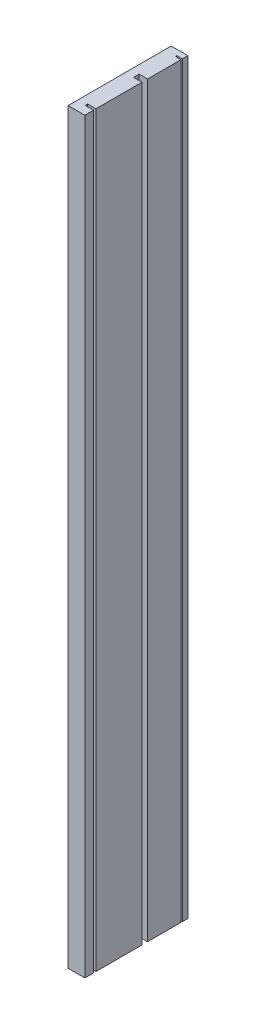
ISO-10303-21;
HEADER;
FILE_DESCRIPTION(('STEP AP214'),'2;1');
FILE_NAME('part.step','',(''),(''),'','','');
FILE_SCHEMA(('AUTOMOTIVE_DESIGN { 1 0 10303 214 1 1 1 1 }'));
ENDSEC;
DATA;
#1=APPLICATION_CONTEXT('core data for automotive mechanical design processes');
#2=APPLICATION_PROTOCOL_DEFINITION('international standard','automotive_design',2000,#1);
#3=PRODUCT_CONTEXT('',#1,'mechanical');
#4=PRODUCT('Part','Part','',(#3));
#5=PRODUCT_RELATED_PRODUCT_CATEGORY('part','',(#4));
#6=PRODUCT_DEFINITION_FORMATION('','',#4);
#7=PRODUCT_DEFINITION_CONTEXT('part definition',#1,'design');
#8=PRODUCT_DEFINITION('design','',#6,#7);
#9=PRODUCT_DEFINITION_SHAPE('','',#8);
#10=(LENGTH_UNIT() NAMED_UNIT(*) SI_UNIT(.MILLI.,.METRE.));
#11=(NAMED_UNIT(*) PLANE_ANGLE_UNIT() SI_UNIT($,.RADIAN.));
#12=(NAMED_UNIT(*) SI_UNIT($,.STERADIAN.) SOLID_ANGLE_UNIT());
#13=UNCERTAINTY_MEASURE_WITH_UNIT(LENGTH_MEASURE(1.E-05),#10,'distance_accuracy_value','');
#14=(GEOMETRIC_REPRESENTATION_CONTEXT(3) GLOBAL_UNCERTAINTY_ASSIGNED_CONTEXT((#13)) GLOBAL_UNIT_ASSIGNED_CONTEXT((#10,
#11,#12)) REPRESENTATION_CONTEXT('',''));
#15=CARTESIAN_POINT('',(0.,0.,0.));
#16=DIRECTION('',(0.,0.,1.));
#17=DIRECTION('',(1.,0.,0.));
#18=AXIS2_PLACEMENT_3D('',#15,#16,#17);
#19=CARTESIAN_POINT('',(19.05,0.,0.));
#20=DIRECTION('',(-1.,0.,0.));
#21=DIRECTION('',(0.,0.,1.));
#22=AXIS2_PLACEMENT_3D('',#19,#20,#21);
#23=PLANE('',#22);
#24=DIRECTION('',(0.,-1.,0.));
#25=VECTOR('',#24,1.);
#26=CARTESIAN_POINT('',(19.05,0.,0.));
#27=LINE('',#26,#25);
#28=CARTESIAN_POINT('',(19.05,1219.2,2.22044604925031E-13));
#29=VERTEX_POINT('',#28);
#30=CARTESIAN_POINT('',(19.05,-482.6,0.));
#31=VERTEX_POINT('',#30);
#32=EDGE_CURVE('E85',#29,#31,#27,.T.);
#33=ORIENTED_EDGE('',*,*,#32,.T.);
#34=DIRECTION('',(0.,0.,-1.));
#35=VECTOR('',#34,1.);
#36=CARTESIAN_POINT('',(19.05,-482.6,-19.8119999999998));
#37=LINE('',#36,#35);
#38=CARTESIAN_POINT('',(19.05,-482.6,-19.8119999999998));
#39=VERTEX_POINT('',#38);
#40=EDGE_CURVE('E179',#31,#39,#37,.T.);
#41=ORIENTED_EDGE('',*,*,#40,.T.);
#42=DIRECTION('',(0.,1.,0.));
#43=VECTOR('',#42,1.);
#44=CARTESIAN_POINT('',(19.05,0.,-19.8119999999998));
#45=LINE('',#44,#43);
#46=CARTESIAN_POINT('',(19.05,1219.2,-19.8119999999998));
#47=VERTEX_POINT('',#46);
#48=EDGE_CURVE('E99',#39,#47,#45,.T.);
#49=ORIENTED_EDGE('',*,*,#48,.T.);
#50=DIRECTION('',(0.,0.,1.));
#51=VECTOR('',#50,1.);
#52=CARTESIAN_POINT('',(19.05,1219.2,2.22044604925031E-13));
#53=LINE('',#52,#51);
#54=EDGE_CURVE('E63',#47,#29,#53,.T.);
#55=ORIENTED_EDGE('',*,*,#54,.T.);
#56=EDGE_LOOP('',(#33,#41,#49,#55));
#57=FACE_BOUND('',#56,.T.);
#58=ADVANCED_FACE('F39',(#57),#23,.F.);
#59=CARTESIAN_POINT('',(19.05,1219.2,-130.175));
#60=VERTEX_POINT('',#59);
#61=CARTESIAN_POINT('',(19.05,1219.2,-25.3999999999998));
#62=VERTEX_POINT('',#61);
#63=EDGE_CURVE('E237',#60,#62,#53,.T.);
#64=ORIENTED_EDGE('',*,*,#63,.T.);
#65=DIRECTION('',(0.,1.,0.));
#66=VECTOR('',#65,1.);
#67=CARTESIAN_POINT('',(19.05,0.,-25.3999999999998));
#68=LINE('',#67,#66);
#69=CARTESIAN_POINT('',(19.05,-482.6,-25.3999999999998));
#70=VERTEX_POINT('',#69);
#71=EDGE_CURVE('E151',#70,#62,#68,.T.);
#72=ORIENTED_EDGE('',*,*,#71,.F.);
#73=DIRECTION('',(0.,0.,-1.));
#74=VECTOR('',#73,1.);
#75=CARTESIAN_POINT('',(19.05,-482.6,-130.175));
#76=LINE('',#75,#74);
#77=CARTESIAN_POINT('',(19.05,-482.6,-130.175));
#78=VERTEX_POINT('',#77);
#79=EDGE_CURVE('E167',#70,#78,#76,.T.);
#80=ORIENTED_EDGE('',*,*,#79,.T.);
#81=DIRECTION('',(0.,1.,0.));
#82=VECTOR('',#81,1.);
#83=CARTESIAN_POINT('',(19.05,0.,-130.175));
#84=LINE('',#83,#82);
#85=EDGE_CURVE('E140',#78,#60,#84,.T.);
#86=ORIENTED_EDGE('',*,*,#85,.T.);
#87=EDGE_LOOP('',(#64,#72,#80,#86));
#88=FACE_BOUND('',#87,.T.);
#89=ADVANCED_FACE('F233',(#88),#23,.F.);
#90=CARTESIAN_POINT('',(19.05,1219.2,-234.95));
#91=VERTEX_POINT('',#90);
#92=CARTESIAN_POINT('',(19.05,1219.2,-222.25));
#93=VERTEX_POINT('',#92);
#94=EDGE_CURVE('E94',#91,#93,#53,.T.);
#95=ORIENTED_EDGE('',*,*,#94,.T.);
#96=DIRECTION('',(0.,1.,0.));
#97=VECTOR('',#96,1.);
#98=CARTESIAN_POINT('',(19.05,0.,-222.25));
#99=LINE('',#98,#97);
#100=CARTESIAN_POINT('',(19.05,-482.6,-222.25));
#101=VERTEX_POINT('',#100);
#102=EDGE_CURVE('E120',#101,#93,#99,.T.);
#103=ORIENTED_EDGE('',*,*,#102,.F.);
#104=DIRECTION('',(0.,0.,-1.));
#105=VECTOR('',#104,1.);
#106=CARTESIAN_POINT('',(19.05,-482.6,-234.95));
#107=LINE('',#106,#105);
#108=CARTESIAN_POINT('',(19.05,-482.6,-234.95));
#109=VERTEX_POINT('',#108);
#110=EDGE_CURVE('E188',#101,#109,#107,.T.);
#111=ORIENTED_EDGE('',*,*,#110,.T.);
#112=DIRECTION('',(0.,1.,0.));
#113=VECTOR('',#112,1.);
#114=CARTESIAN_POINT('',(19.05,0.,-234.95));
#115=LINE('',#114,#113);
#116=EDGE_CURVE('E108',#109,#91,#115,.T.);
#117=ORIENTED_EDGE('',*,*,#116,.T.);
#118=EDGE_LOOP('',(#95,#103,#111,#117));
#119=FACE_BOUND('',#118,.T.);
#120=ADVANCED_FACE('F321',(#119),#23,.F.);
#121=CARTESIAN_POINT('',(19.05,0.,0.));
#122=DIRECTION('',(0.,0.,-1.));
#123=DIRECTION('',(0.,1.,0.));
#124=AXIS2_PLACEMENT_3D('',#121,#122,#123);
#125=PLANE('',#124);
#126=DIRECTION('',(0.,-1.,0.));
#127=VECTOR('',#126,1.);
#128=CARTESIAN_POINT('',(-19.05,0.,0.));
#129=LINE('',#128,#127);
#130=CARTESIAN_POINT('',(-19.05,1219.2,2.22044604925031E-13));
#131=VERTEX_POINT('',#130);
#132=CARTESIAN_POINT('',(-19.05,-482.6,0.));
#133=VERTEX_POINT('',#132);
#134=EDGE_CURVE('E92',#131,#133,#129,.T.);
#135=ORIENTED_EDGE('',*,*,#134,.T.);
#136=DIRECTION('',(1.,0.,0.));
#137=VECTOR('',#136,1.);
#138=CARTESIAN_POINT('',(19.05,-482.6,0.));
#139=LINE('',#138,#137);
#140=EDGE_CURVE('E182',#133,#31,#139,.T.);
#141=ORIENTED_EDGE('',*,*,#140,.T.);
#142=ORIENTED_EDGE('',*,*,#32,.F.);
#143=DIRECTION('',(-1.,0.,0.));
#144=VECTOR('',#143,1.);
#145=CARTESIAN_POINT('',(19.05,1219.2,2.22044604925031E-13));
#146=LINE('',#145,#144);
#147=EDGE_CURVE('E47',#29,#131,#146,.T.);
#148=ORIENTED_EDGE('',*,*,#147,.T.);
#149=EDGE_LOOP('',(#135,#141,#142,#148));
#150=FACE_BOUND('',#149,.T.);
#151=ADVANCED_FACE('F41',(#150),#125,.F.);
#152=CARTESIAN_POINT('',(19.05,0.,-234.95));
#153=DIRECTION('',(0.,0.,1.));
#154=DIRECTION('',(0.,-1.,0.));
#155=AXIS2_PLACEMENT_3D('',#152,#153,#154);
#156=PLANE('',#155);
#157=DIRECTION('',(0.,1.,0.));
#158=VECTOR('',#157,1.);
#159=CARTESIAN_POINT('',(-19.05,0.,-234.95));
#160=LINE('',#159,#158);
#161=CARTESIAN_POINT('',(-19.05,-482.6,-234.95));
#162=VERTEX_POINT('',#161);
#163=CARTESIAN_POINT('',(-19.05,1219.2,-234.95));
#164=VERTEX_POINT('',#163);
#165=EDGE_CURVE('E86',#162,#164,#160,.T.);
#166=ORIENTED_EDGE('',*,*,#165,.T.);
#167=DIRECTION('',(-1.,0.,0.));
#168=VECTOR('',#167,1.);
#169=CARTESIAN_POINT('',(19.05,1219.2,-234.95));
#170=LINE('',#169,#168);
#171=EDGE_CURVE('E11',#91,#164,#170,.T.);
#172=ORIENTED_EDGE('',*,*,#171,.F.);
#173=ORIENTED_EDGE('',*,*,#116,.F.);
#174=DIRECTION('',(-1.,0.,0.));
#175=VECTOR('',#174,1.);
#176=CARTESIAN_POINT('',(-19.05,-482.6,-234.95));
#177=LINE('',#176,#175);
#178=EDGE_CURVE('E185',#109,#162,#177,.T.);
#179=ORIENTED_EDGE('',*,*,#178,.T.);
#180=EDGE_LOOP('',(#166,#172,#173,#179));
#181=FACE_BOUND('',#180,.T.);
#182=ADVANCED_FACE('F329',(#181),#156,.F.);
#183=CARTESIAN_POINT('',(19.05,1219.2,2.22044604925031E-13));
#184=DIRECTION('',(0.,-1.,0.));
#185=DIRECTION('',(0.,0.,-1.));
#186=AXIS2_PLACEMENT_3D('',#183,#184,#185);
#187=PLANE('',#186);
#188=ORIENTED_EDGE('',*,*,#54,.F.);
#189=DIRECTION('',(1.,0.,0.));
#190=VECTOR('',#189,1.);
#191=CARTESIAN_POINT('',(0.,1219.2,-19.8119999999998));
#192=LINE('',#191,#190);
#193=CARTESIAN_POINT('',(0.,1219.2,-19.8119999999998));
#194=VERTEX_POINT('',#193);
#195=EDGE_CURVE('E155',#194,#47,#192,.T.);
#196=ORIENTED_EDGE('',*,*,#195,.F.);
#197=DIRECTION('',(0.,0.,1.));
#198=VECTOR('',#197,1.);
#199=CARTESIAN_POINT('',(0.,1219.2,-25.3999999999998));
#200=LINE('',#199,#198);
#201=CARTESIAN_POINT('',(0.,1219.2,-25.3999999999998));
#202=VERTEX_POINT('',#201);
#203=EDGE_CURVE('E162',#202,#194,#200,.T.);
#204=ORIENTED_EDGE('',*,*,#203,.F.);
#205=DIRECTION('',(-1.,0.,0.));
#206=VECTOR('',#205,1.);
#207=CARTESIAN_POINT('',(19.05,1219.2,-25.3999999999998));
#208=LINE('',#207,#206);
#209=EDGE_CURVE('E133',#62,#202,#208,.T.);
#210=ORIENTED_EDGE('',*,*,#209,.F.);
#211=ORIENTED_EDGE('',*,*,#63,.F.);
#212=DIRECTION('',(1.,0.,0.));
#213=VECTOR('',#212,1.);
#214=CARTESIAN_POINT('',(0.,1219.2,-130.175));
#215=LINE('',#214,#213);
#216=CARTESIAN_POINT('',(0.,1219.2,-130.175));
#217=VERTEX_POINT('',#216);
#218=EDGE_CURVE('E130',#217,#60,#215,.T.);
#219=ORIENTED_EDGE('',*,*,#218,.F.);
#220=DIRECTION('',(0.,0.,1.));
#221=VECTOR('',#220,1.);
#222=CARTESIAN_POINT('',(0.,1219.2,-142.875));
#223=LINE('',#222,#221);
#224=CARTESIAN_POINT('',(0.,1219.2,-142.875));
#225=VERTEX_POINT('',#224);
#226=EDGE_CURVE('E137',#225,#217,#223,.T.);
#227=ORIENTED_EDGE('',*,*,#226,.F.);
#228=DIRECTION('',(-1.,0.,0.));
#229=VECTOR('',#228,1.);
#230=CARTESIAN_POINT('',(19.05,1219.2,-142.875));
#231=LINE('',#230,#229);
#232=CARTESIAN_POINT('',(19.05,1219.2,-142.875));
#233=VERTEX_POINT('',#232);
#234=EDGE_CURVE('E134',#233,#225,#231,.T.);
#235=ORIENTED_EDGE('',*,*,#234,.F.);
#236=CARTESIAN_POINT('',(19.05,1219.2,-219.075));
#237=VERTEX_POINT('',#236);
#238=EDGE_CURVE('E107',#237,#233,#53,.T.);
#239=ORIENTED_EDGE('',*,*,#238,.F.);
#240=DIRECTION('',(1.,0.,0.));
#241=VECTOR('',#240,1.);
#242=CARTESIAN_POINT('',(19.05,1219.2,-219.075));
#243=LINE('',#242,#241);
#244=CARTESIAN_POINT('',(6.35,1219.2,-219.075));
#245=VERTEX_POINT('',#244);
#246=EDGE_CURVE('E54',#245,#237,#243,.T.);
#247=ORIENTED_EDGE('',*,*,#246,.F.);
#248=DIRECTION('',(0.,0.,1.));
#249=VECTOR('',#248,1.);
#250=CARTESIAN_POINT('',(6.35,1219.2,-219.075));
#251=LINE('',#250,#249);
#252=CARTESIAN_POINT('',(6.35,1219.2,-222.25));
#253=VERTEX_POINT('',#252);
#254=EDGE_CURVE('E115',#253,#245,#251,.T.);
#255=ORIENTED_EDGE('',*,*,#254,.F.);
#256=DIRECTION('',(-1.,0.,0.));
#257=VECTOR('',#256,1.);
#258=CARTESIAN_POINT('',(6.35,1219.2,-222.25));
#259=LINE('',#258,#257);
#260=EDGE_CURVE('E111',#93,#253,#259,.T.);
#261=ORIENTED_EDGE('',*,*,#260,.F.);
#262=ORIENTED_EDGE('',*,*,#94,.F.);
#263=ORIENTED_EDGE('',*,*,#171,.T.);
#264=DIRECTION('',(0.,0.,1.));
#265=VECTOR('',#264,1.);
#266=CARTESIAN_POINT('',(-19.05,1219.2,2.22044604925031E-13));
#267=LINE('',#266,#265);
#268=EDGE_CURVE('E76',#164,#131,#267,.T.);
#269=ORIENTED_EDGE('',*,*,#268,.T.);
#270=ORIENTED_EDGE('',*,*,#147,.F.);
#271=EDGE_LOOP('',(#188,#196,#204,#210,#211,#219,#227,#235,#239,#247,#255,#261,#262,#263,#269,#270));
#272=FACE_BOUND('',#271,.T.);
#273=ADVANCED_FACE('F78',(#272),#187,.F.);
#274=ORIENTED_EDGE('',*,*,#238,.T.);
#275=DIRECTION('',(0.,1.,0.));
#276=VECTOR('',#275,1.);
#277=CARTESIAN_POINT('',(19.05,0.,-142.875));
#278=LINE('',#277,#276);
#279=CARTESIAN_POINT('',(19.05,-482.6,-142.875));
#280=VERTEX_POINT('',#279);
#281=EDGE_CURVE('E146',#280,#233,#278,.T.);
#282=ORIENTED_EDGE('',*,*,#281,.F.);
#283=DIRECTION('',(0.,0.,-1.));
#284=VECTOR('',#283,1.);
#285=CARTESIAN_POINT('',(19.05,-482.6,-219.075));
#286=LINE('',#285,#284);
#287=CARTESIAN_POINT('',(19.05,-482.6,-219.075));
#288=VERTEX_POINT('',#287);
#289=EDGE_CURVE('E200',#280,#288,#286,.T.);
#290=ORIENTED_EDGE('',*,*,#289,.T.);
#291=DIRECTION('',(0.,1.,0.));
#292=VECTOR('',#291,1.);
#293=CARTESIAN_POINT('',(19.05,0.,-219.075));
#294=LINE('',#293,#292);
#295=EDGE_CURVE('E123',#288,#237,#294,.T.);
#296=ORIENTED_EDGE('',*,*,#295,.T.);
#297=EDGE_LOOP('',(#274,#282,#290,#296));
#298=FACE_BOUND('',#297,.T.);
#299=ADVANCED_FACE('F286',(#298),#23,.F.);
#300=CARTESIAN_POINT('',(-19.05,0.,0.));
#301=DIRECTION('',(-1.,0.,0.));
#302=DIRECTION('',(0.,0.,1.));
#303=AXIS2_PLACEMENT_3D('',#300,#301,#302);
#304=PLANE('',#303);
#305=ORIENTED_EDGE('',*,*,#134,.F.);
#306=ORIENTED_EDGE('',*,*,#268,.F.);
#307=ORIENTED_EDGE('',*,*,#165,.F.);
#308=DIRECTION('',(0.,0.,1.));
#309=VECTOR('',#308,1.);
#310=CARTESIAN_POINT('',(-19.05,-482.6,0.));
#311=LINE('',#310,#309);
#312=EDGE_CURVE('E98',#162,#133,#311,.T.);
#313=ORIENTED_EDGE('',*,*,#312,.T.);
#314=EDGE_LOOP('',(#305,#306,#307,#313));
#315=FACE_BOUND('',#314,.T.);
#316=ADVANCED_FACE('F96',(#315),#304,.T.);
#317=CARTESIAN_POINT('',(6.35,0.,-222.25));
#318=DIRECTION('',(0.,0.,-1.));
#319=DIRECTION('',(-1.,0.,0.));
#320=AXIS2_PLACEMENT_3D('',#317,#318,#319);
#321=PLANE('',#320);
#322=ORIENTED_EDGE('',*,*,#260,.T.);
#323=DIRECTION('',(0.,1.,0.));
#324=VECTOR('',#323,1.);
#325=CARTESIAN_POINT('',(6.35,0.,-222.25));
#326=LINE('',#325,#324);
#327=CARTESIAN_POINT('',(6.35,-482.6,-222.25));
#328=VERTEX_POINT('',#327);
#329=EDGE_CURVE('E119',#328,#253,#326,.T.);
#330=ORIENTED_EDGE('',*,*,#329,.F.);
#331=DIRECTION('',(1.,0.,0.));
#332=VECTOR('',#331,1.);
#333=CARTESIAN_POINT('',(19.05,-482.6,-222.25));
#334=LINE('',#333,#332);
#335=EDGE_CURVE('E191',#328,#101,#334,.T.);
#336=ORIENTED_EDGE('',*,*,#335,.T.);
#337=ORIENTED_EDGE('',*,*,#102,.T.);
#338=EDGE_LOOP('',(#322,#330,#336,#337));
#339=FACE_BOUND('',#338,.T.);
#340=ADVANCED_FACE('F278',(#339),#321,.F.);
#341=CARTESIAN_POINT('',(19.05,0.,-219.075));
#342=DIRECTION('',(0.,0.,1.));
#343=DIRECTION('',(1.,0.,0.));
#344=AXIS2_PLACEMENT_3D('',#341,#342,#343);
#345=PLANE('',#344);
#346=ORIENTED_EDGE('',*,*,#246,.T.);
#347=ORIENTED_EDGE('',*,*,#295,.F.);
#348=DIRECTION('',(-1.,0.,0.));
#349=VECTOR('',#348,1.);
#350=CARTESIAN_POINT('',(6.35,-482.6,-219.075));
#351=LINE('',#350,#349);
#352=CARTESIAN_POINT('',(6.35,-482.6,-219.075));
#353=VERTEX_POINT('',#352);
#354=EDGE_CURVE('E197',#288,#353,#351,.T.);
#355=ORIENTED_EDGE('',*,*,#354,.T.);
#356=DIRECTION('',(0.,1.,0.));
#357=VECTOR('',#356,1.);
#358=CARTESIAN_POINT('',(6.35,0.,-219.075));
#359=LINE('',#358,#357);
#360=EDGE_CURVE('E126',#353,#245,#359,.T.);
#361=ORIENTED_EDGE('',*,*,#360,.T.);
#362=EDGE_LOOP('',(#346,#347,#355,#361));
#363=FACE_BOUND('',#362,.T.);
#364=ADVANCED_FACE('F291',(#363),#345,.F.);
#365=CARTESIAN_POINT('',(6.35,0.,-219.075));
#366=DIRECTION('',(-1.,0.,0.));
#367=DIRECTION('',(0.,0.,1.));
#368=AXIS2_PLACEMENT_3D('',#365,#366,#367);
#369=PLANE('',#368);
#370=ORIENTED_EDGE('',*,*,#254,.T.);
#371=ORIENTED_EDGE('',*,*,#360,.F.);
#372=DIRECTION('',(0.,0.,-1.));
#373=VECTOR('',#372,1.);
#374=CARTESIAN_POINT('',(6.35,-482.6,-222.25));
#375=LINE('',#374,#373);
#376=EDGE_CURVE('E194',#353,#328,#375,.T.);
#377=ORIENTED_EDGE('',*,*,#376,.T.);
#378=ORIENTED_EDGE('',*,*,#329,.T.);
#379=EDGE_LOOP('',(#370,#371,#377,#378));
#380=FACE_BOUND('',#379,.T.);
#381=ADVANCED_FACE('F270',(#380),#369,.F.);
#382=CARTESIAN_POINT('',(0.,0.,-130.175));
#383=DIRECTION('',(0.,0.,1.));
#384=DIRECTION('',(1.,0.,0.));
#385=AXIS2_PLACEMENT_3D('',#382,#383,#384);
#386=PLANE('',#385);
#387=ORIENTED_EDGE('',*,*,#218,.T.);
#388=ORIENTED_EDGE('',*,*,#85,.F.);
#389=DIRECTION('',(-1.,0.,0.));
#390=VECTOR('',#389,1.);
#391=CARTESIAN_POINT('',(0.,-482.6,-130.175));
#392=LINE('',#391,#390);
#393=CARTESIAN_POINT('',(0.,-482.6,-130.175));
#394=VERTEX_POINT('',#393);
#395=EDGE_CURVE('E170',#78,#394,#392,.T.);
#396=ORIENTED_EDGE('',*,*,#395,.T.);
#397=DIRECTION('',(0.,1.,0.));
#398=VECTOR('',#397,1.);
#399=CARTESIAN_POINT('',(0.,0.,-130.175));
#400=LINE('',#399,#398);
#401=EDGE_CURVE('E114',#394,#217,#400,.T.);
#402=ORIENTED_EDGE('',*,*,#401,.T.);
#403=EDGE_LOOP('',(#387,#388,#396,#402));
#404=FACE_BOUND('',#403,.T.);
#405=ADVANCED_FACE('F214',(#404),#386,.F.);
#406=CARTESIAN_POINT('',(0.,0.,-142.875));
#407=DIRECTION('',(-1.,0.,0.));
#408=DIRECTION('',(0.,0.,1.));
#409=AXIS2_PLACEMENT_3D('',#406,#407,#408);
#410=PLANE('',#409);
#411=ORIENTED_EDGE('',*,*,#226,.T.);
#412=ORIENTED_EDGE('',*,*,#401,.F.);
#413=DIRECTION('',(0.,0.,-1.));
#414=VECTOR('',#413,1.);
#415=CARTESIAN_POINT('',(0.,-482.6,-142.875));
#416=LINE('',#415,#414);
#417=CARTESIAN_POINT('',(0.,-482.6,-142.875));
#418=VERTEX_POINT('',#417);
#419=EDGE_CURVE('E206',#394,#418,#416,.T.);
#420=ORIENTED_EDGE('',*,*,#419,.T.);
#421=DIRECTION('',(0.,1.,0.));
#422=VECTOR('',#421,1.);
#423=CARTESIAN_POINT('',(0.,0.,-142.875));
#424=LINE('',#423,#422);
#425=EDGE_CURVE('E143',#418,#225,#424,.T.);
#426=ORIENTED_EDGE('',*,*,#425,.T.);
#427=EDGE_LOOP('',(#411,#412,#420,#426));
#428=FACE_BOUND('',#427,.T.);
#429=ADVANCED_FACE('F411',(#428),#410,.F.);
#430=CARTESIAN_POINT('',(19.05,0.,-142.875));
#431=DIRECTION('',(0.,0.,-1.));
#432=DIRECTION('',(-1.,0.,0.));
#433=AXIS2_PLACEMENT_3D('',#430,#431,#432);
#434=PLANE('',#433);
#435=ORIENTED_EDGE('',*,*,#234,.T.);
#436=ORIENTED_EDGE('',*,*,#425,.F.);
#437=DIRECTION('',(1.,0.,0.));
#438=VECTOR('',#437,1.);
#439=CARTESIAN_POINT('',(19.05,-482.6,-142.875));
#440=LINE('',#439,#438);
#441=EDGE_CURVE('E203',#418,#280,#440,.T.);
#442=ORIENTED_EDGE('',*,*,#441,.T.);
#443=ORIENTED_EDGE('',*,*,#281,.T.);
#444=EDGE_LOOP('',(#435,#436,#442,#443));
#445=FACE_BOUND('',#444,.T.);
#446=ADVANCED_FACE('F400',(#445),#434,.F.);
#447=CARTESIAN_POINT('',(0.,0.,-19.8119999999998));
#448=DIRECTION('',(0.,0.,1.));
#449=DIRECTION('',(1.,0.,0.));
#450=AXIS2_PLACEMENT_3D('',#447,#448,#449);
#451=PLANE('',#450);
#452=ORIENTED_EDGE('',*,*,#195,.T.);
#453=ORIENTED_EDGE('',*,*,#48,.F.);
#454=DIRECTION('',(-1.,0.,0.));
#455=VECTOR('',#454,1.);
#456=CARTESIAN_POINT('',(0.,-482.6,-19.8119999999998));
#457=LINE('',#456,#455);
#458=CARTESIAN_POINT('',(0.,-482.6,-19.8119999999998));
#459=VERTEX_POINT('',#458);
#460=EDGE_CURVE('E176',#39,#459,#457,.T.);
#461=ORIENTED_EDGE('',*,*,#460,.T.);
#462=DIRECTION('',(0.,1.,0.));
#463=VECTOR('',#462,1.);
#464=CARTESIAN_POINT('',(0.,0.,-19.8119999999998));
#465=LINE('',#464,#463);
#466=EDGE_CURVE('E102',#459,#194,#465,.T.);
#467=ORIENTED_EDGE('',*,*,#466,.T.);
#468=EDGE_LOOP('',(#452,#453,#461,#467));
#469=FACE_BOUND('',#468,.T.);
#470=ADVANCED_FACE('F313',(#469),#451,.F.);
#471=CARTESIAN_POINT('',(0.,0.,-25.3999999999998));
#472=DIRECTION('',(-1.,0.,0.));
#473=DIRECTION('',(0.,0.,1.));
#474=AXIS2_PLACEMENT_3D('',#471,#472,#473);
#475=PLANE('',#474);
#476=ORIENTED_EDGE('',*,*,#203,.T.);
#477=ORIENTED_EDGE('',*,*,#466,.F.);
#478=DIRECTION('',(0.,0.,-1.));
#479=VECTOR('',#478,1.);
#480=CARTESIAN_POINT('',(0.,-482.6,-25.3999999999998));
#481=LINE('',#480,#479);
#482=CARTESIAN_POINT('',(0.,-482.6,-25.3999999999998));
#483=VERTEX_POINT('',#482);
#484=EDGE_CURVE('E173',#459,#483,#481,.T.);
#485=ORIENTED_EDGE('',*,*,#484,.T.);
#486=DIRECTION('',(0.,1.,0.));
#487=VECTOR('',#486,1.);
#488=CARTESIAN_POINT('',(0.,0.,-25.3999999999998));
#489=LINE('',#488,#487);
#490=EDGE_CURVE('E154',#483,#202,#489,.T.);
#491=ORIENTED_EDGE('',*,*,#490,.T.);
#492=EDGE_LOOP('',(#476,#477,#485,#491));
#493=FACE_BOUND('',#492,.T.);
#494=ADVANCED_FACE('F252',(#493),#475,.F.);
#495=CARTESIAN_POINT('',(19.05,0.,-25.3999999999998));
#496=DIRECTION('',(0.,0.,-1.));
#497=DIRECTION('',(-1.,0.,0.));
#498=AXIS2_PLACEMENT_3D('',#495,#496,#497);
#499=PLANE('',#498);
#500=ORIENTED_EDGE('',*,*,#209,.T.);
#501=ORIENTED_EDGE('',*,*,#490,.F.);
#502=DIRECTION('',(1.,0.,0.));
#503=VECTOR('',#502,1.);
#504=CARTESIAN_POINT('',(19.05,-482.6,-25.3999999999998));
#505=LINE('',#504,#503);
#506=EDGE_CURVE('E124',#483,#70,#505,.T.);
#507=ORIENTED_EDGE('',*,*,#506,.T.);
#508=ORIENTED_EDGE('',*,*,#71,.T.);
#509=EDGE_LOOP('',(#500,#501,#507,#508));
#510=FACE_BOUND('',#509,.T.);
#511=ADVANCED_FACE('F241',(#510),#499,.F.);
#512=CARTESIAN_POINT('',(88.1761,-482.6,-77.851));
#513=DIRECTION('',(0.,1.,0.));
#514=DIRECTION('',(1.,0.,0.));
#515=AXIS2_PLACEMENT_3D('',#512,#513,#514);
#516=PLANE('',#515);
#517=ORIENTED_EDGE('',*,*,#484,.F.);
#518=ORIENTED_EDGE('',*,*,#460,.F.);
#519=ORIENTED_EDGE('',*,*,#40,.F.);
#520=ORIENTED_EDGE('',*,*,#140,.F.);
#521=ORIENTED_EDGE('',*,*,#312,.F.);
#522=ORIENTED_EDGE('',*,*,#178,.F.);
#523=ORIENTED_EDGE('',*,*,#110,.F.);
#524=ORIENTED_EDGE('',*,*,#335,.F.);
#525=ORIENTED_EDGE('',*,*,#376,.F.);
#526=ORIENTED_EDGE('',*,*,#354,.F.);
#527=ORIENTED_EDGE('',*,*,#289,.F.);
#528=ORIENTED_EDGE('',*,*,#441,.F.);
#529=ORIENTED_EDGE('',*,*,#419,.F.);
#530=ORIENTED_EDGE('',*,*,#395,.F.);
#531=ORIENTED_EDGE('',*,*,#79,.F.);
#532=ORIENTED_EDGE('',*,*,#506,.F.);
#533=EDGE_LOOP('',(#517,#518,#519,#520,#521,#522,#523,#524,#525,#526,#527,#528,#529,#530,#531,#532));
#534=FACE_BOUND('',#533,.T.);
#535=ADVANCED_FACE('F225',(#534),#516,.F.);
#536=CLOSED_SHELL('',(#58,#89,#120,#151,#182,#273,#299,#316,#340,#364,#381,#405,#429,#446,#470,
#494,#511,#535));
#537=MANIFOLD_SOLID_BREP('B2',#536);
#538=ADVANCED_BREP_SHAPE_REPRESENTATION('',(#18,#537),#14);
#539=SHAPE_DEFINITION_REPRESENTATION(#9,#538);
ENDSEC;
END-ISO-10303-21;
